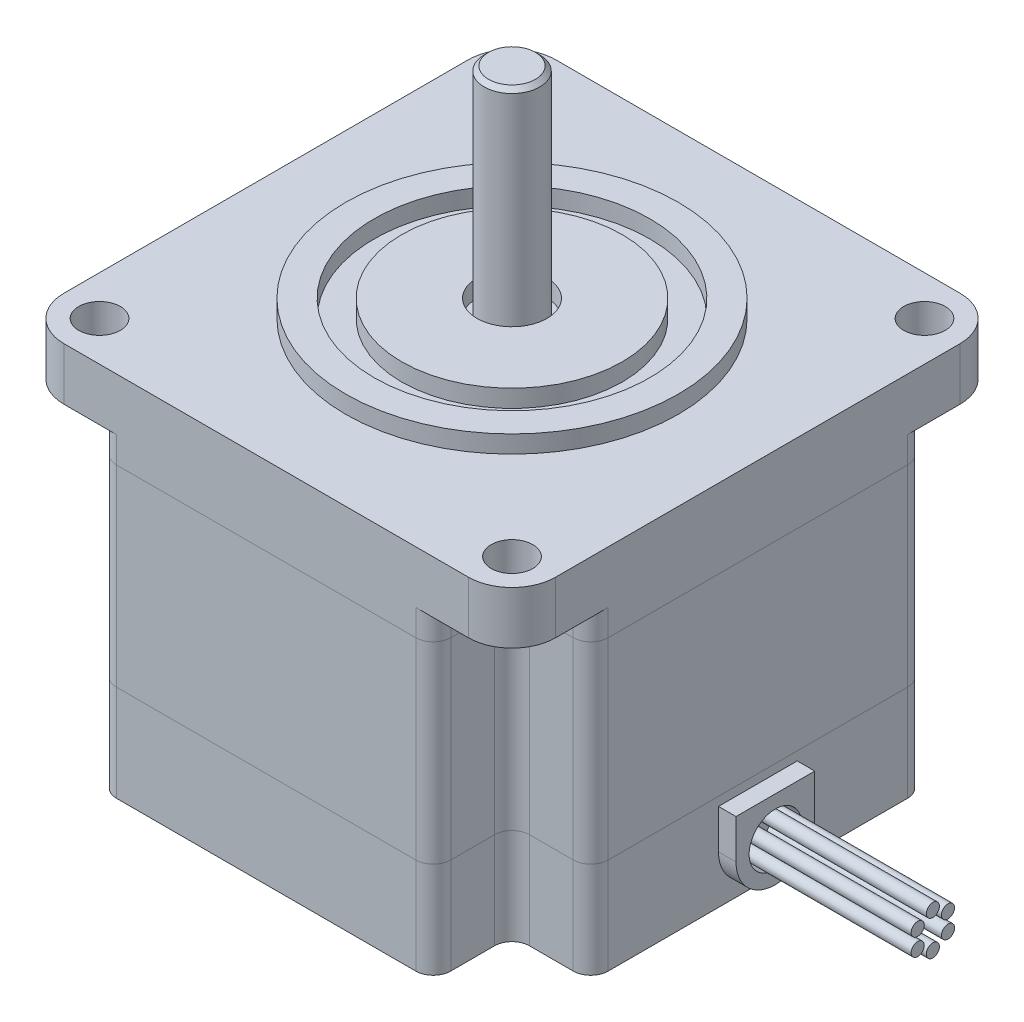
from build123d import *

# Parameters (mm, degrees)
SKETCH1_W             = 56.2
SKETCH1_H             = 56.2
SKETCH1_R             = 2.375
BOSS_EXTRUDE2_DEPTH   = 11
SKETCH2_W             = 56.2
SKETCH2_H             = 56.2
SKETCH2_R             = 2.375
BOSS_EXTRUDE3_DEPTH   = 22
SKETCH3_W             = 56.2
SKETCH3_H             = 56.2
SKETCH3_R             = 2.375
BOSS_EXTRUDE4_DEPTH   = 9
SKETCH4_R             = 3
BOSS_EXTRUDE5_DEPTH   = 2
SKETCH5_R             = 0.75
BOSS_EXTRUDE6_DEPTH   = 20
BOSS_EXTRUDE6_2_DEPTH = 20
BOSS_EXTRUDE6_3_DEPTH = 20
BOSS_EXTRUDE6_4_DEPTH = 20
BOSS_EXTRUDE6_5_DEPTH = 20
BOSS_EXTRUDE6_6_DEPTH = 20
SKETCH6_R             = 19
SKETCH6_R_2           = 15.75
SKETCH6_R_3           = 12.6
SKETCH6_R_4           = 4
BOSS_EXTRUDE7_DEPTH   = 2
SKETCH7_R             = 3.175
BOSS_EXTRUDE8_DEPTH   = 25
SKETCH11_W            = 9
SKETCH11_H            = 9
CUT_EXTRUDE1_DEPTH    = 36
FILLET1_R             = 5
FILLET2_R             = 2
FILLET3_R             = 2
CHAMFER1_SIZE         = 0.5
FILLET4_R             = 2


with BuildPart() as part:
    # Sketch1 → Boss-Extrude2 (new body)
    with BuildSketch(Plane(origin=(0, 0, 0), x_dir=(1, 0, 0), z_dir=(0, 1, 0))):
        Rectangle(SKETCH1_W, SKETCH1_H)
        with Locations(Location((23.57, 23.57, 0), (0, 0, 270))):
            Circle(SKETCH1_R, mode=Mode.SUBTRACT)
        with Locations(Location((23.57, -23.57, 0), (0, 0, 270))):
            Circle(SKETCH1_R, mode=Mode.SUBTRACT)
        with Locations(Location((-23.57, -23.57, 0), (0, 0, 270))):
            Circle(SKETCH1_R, mode=Mode.SUBTRACT)
        with Locations(Location((-23.57, 23.57, 0), (0, 0, 270))):
            Circle(SKETCH1_R, mode=Mode.SUBTRACT)
    extrude(amount=BOSS_EXTRUDE2_DEPTH)


with BuildPart() as body_2:
    # Sketch2 → Boss-Extrude3 (new body)
    with BuildSketch(Plane(origin=(0, 11, 0), x_dir=(1, 0, 0), z_dir=(0, 1, 0))):
        Rectangle(SKETCH2_W, SKETCH2_H)
        with Locations(Location((-23.57, -23.57, 0), (0, 0, 270))):
            Circle(SKETCH2_R, mode=Mode.SUBTRACT)
        with Locations(Location((23.57, -23.57, 0), (0, 0, 270))):
            Circle(SKETCH2_R, mode=Mode.SUBTRACT)
        with Locations(Location((23.57, 23.57, 0), (0, 0, 270))):
            Circle(SKETCH2_R, mode=Mode.SUBTRACT)
        with Locations(Location((-23.57, 23.57, 0), (0, 0, 270))):
            Circle(SKETCH2_R, mode=Mode.SUBTRACT)
    extrude(amount=BOSS_EXTRUDE3_DEPTH)


with BuildPart() as body_3:
    # Sketch3 → Boss-Extrude4 (new body)
    with BuildSketch(Plane(origin=(0, 33, 0), x_dir=(1, 0, 0), z_dir=(0, 1, 0))):
        Rectangle(SKETCH3_W, SKETCH3_H)
        with Locations(Location((23.57, 23.57, 0), (0, 0, 270))):
            Circle(SKETCH3_R, mode=Mode.SUBTRACT)
        with Locations(Location((23.57, -23.57, 0), (0, 0, 270))):
            Circle(SKETCH3_R, mode=Mode.SUBTRACT)
        with Locations(Location((-23.57, -23.57, 0), (0, 0, 270))):
            Circle(SKETCH3_R, mode=Mode.SUBTRACT)
        with Locations(Location((-23.57, 23.57, 0), (0, 0, 270))):
            Circle(SKETCH3_R, mode=Mode.SUBTRACT)
    extrude(amount=BOSS_EXTRUDE4_DEPTH)

    # Sketch6 → Boss-Extrude7 (add)
    # profile 1 of 2: a face of its own
    with BuildSketch(Plane(origin=(0, 42, 0), x_dir=(1, 0, 0), z_dir=(0, 1, 0))):
        with Locations(Location((0, 0, 0), (0, 0, 270))):
            Circle(SKETCH6_R)
        with Locations(Location((0, 0, 0), (0, 0, 270))):
            Circle(SKETCH6_R_2, mode=Mode.SUBTRACT)
    # profile 2 of 2: a face of its own
    with BuildSketch(Plane(origin=(0, 42, 0), x_dir=(1, 0, 0), z_dir=(0, 1, 0))):
        with Locations(Location((0, 0, 0), (0, 0, 270))):
            Circle(SKETCH6_R_3)
        with Locations(Location((0, 0, 0), (0, 0, 270))):
            Circle(SKETCH6_R_4, mode=Mode.SUBTRACT)
    extrude(amount=BOSS_EXTRUDE7_DEPTH)


with BuildPart() as body_4:
    # Sketch4 → Boss-Extrude5 (new body)
    with BuildSketch(Plane(origin=(28.1, 0, 0), x_dir=(0, 0, -1), z_dir=(1, 0, 0))):
        with BuildLine():
            Line((-4.5, 5.5), (-4.5, 10))
            Line((-4.5, 10), (4.5, 10))
            Line((4.5, 10), (4.5, 5.5))
            ThreePointArc((4.5, 5.5), (0, 1), (-4.5, 5.5))
        make_face()
        with Locations((0, 5.5)):
            Circle(SKETCH4_R, mode=Mode.SUBTRACT)
    extrude(amount=BOSS_EXTRUDE5_DEPTH)


with BuildPart() as body_5:
    # Sketch5 → Boss-Extrude6 (new body)
    with BuildSketch(Plane(origin=(28.1, 0, 0), x_dir=(0, 0, -1), z_dir=(1, 0, 0))):
        with Locations((-1.732050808, 4.5)):
            Circle(SKETCH5_R)
    extrude(amount=BOSS_EXTRUDE6_DEPTH)


with BuildPart() as body_6:
    # Sketch5 → Boss-Extrude6 2 (new body)
    with BuildSketch(Plane(origin=(28.1, 0, 0), x_dir=(0, 0, -1), z_dir=(1, 0, 0))):
        with Locations((0, 3.5)):
            Circle(SKETCH5_R)
    extrude(amount=BOSS_EXTRUDE6_2_DEPTH)


with BuildPart() as body_7:
    # Sketch5 → Boss-Extrude6 3 (new body)
    with BuildSketch(Plane(origin=(28.1, 0, 0), x_dir=(0, 0, -1), z_dir=(1, 0, 0))):
        with Locations((-1.732050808, 6.5)):
            Circle(SKETCH5_R)
    extrude(amount=BOSS_EXTRUDE6_3_DEPTH)


with BuildPart() as body_8:
    # Sketch5 → Boss-Extrude6 4 (new body)
    with BuildSketch(Plane(origin=(28.1, 0, 0), x_dir=(0, 0, -1), z_dir=(1, 0, 0))):
        with Locations((0, 7.5)):
            Circle(SKETCH5_R)
    extrude(amount=BOSS_EXTRUDE6_4_DEPTH)


with BuildPart() as body_9:
    # Sketch5 → Boss-Extrude6 5 (new body)
    with BuildSketch(Plane(origin=(28.1, 0, 0), x_dir=(0, 0, -1), z_dir=(1, 0, 0))):
        with Locations((1.732050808, 6.5)):
            Circle(SKETCH5_R)
    extrude(amount=BOSS_EXTRUDE6_5_DEPTH)


with BuildPart() as body_10:
    # Sketch5 → Boss-Extrude6 6 (new body)
    with BuildSketch(Plane(origin=(28.1, 0, 0), x_dir=(0, 0, -1), z_dir=(1, 0, 0))):
        with Locations((1.732050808, 4.5)):
            Circle(SKETCH5_R)
    extrude(amount=BOSS_EXTRUDE6_6_DEPTH)


with BuildPart() as body_11:
    # Sketch7 → Boss-Extrude8 (new body)
    with BuildSketch(Plane(origin=(0, 42, 0), x_dir=(1, 0, 0), z_dir=(0, 1, 0))):
        with Locations(Location((0, 0, 0), (0, 0, 270))):
            Circle(SKETCH7_R)
    extrude(amount=BOSS_EXTRUDE8_DEPTH)

    # Chamfer1
    chamfer1_edges = [body_11.edges().sort_by_distance(p)[0] for p in [
        (0, 67, -3.175),
    ]]
    chamfer(chamfer1_edges, length=CHAMFER1_SIZE)


with BuildPart() as cut_extrude1_tool:
    # Sketch11 → Cut-Extrude1 (new body)
    with BuildSketch(Plane.XZ):
        with Locations((-23.6, 23.6)):
            Rectangle(SKETCH11_W, SKETCH11_H)
        with Locations((23.6, 23.6)):
            Rectangle(SKETCH11_W, SKETCH11_H)
        with Locations((23.6, -23.6)):
            Rectangle(SKETCH11_W, SKETCH11_H)
        with Locations((-23.6, -23.6)):
            Rectangle(SKETCH11_W, SKETCH11_H)
    extrude(amount=-CUT_EXTRUDE1_DEPTH)


with BuildPart() as part_1:
    add(part.part)

    # Cut-Extrude1: cut by cut_extrude1_tool
    add(cut_extrude1_tool.part, mode=Mode.SUBTRACT)

    # Fillet2
    fillet2_edges = [part_1.edges().sort_by_distance(p)[0] for p in [
        (-19.1, 5.5, -28.1),
        (19.1, 5.5, -28.1),
        (28.1, 5.5, 19.1),
        (-19.1, 5.5, 28.1),
        (-19.1, 5.5, 19.1),
        (-28.1, 5.5, 19.1),
        (19.1, 5.5, 19.1),
        (19.1, 5.5, 28.1),
        (19.1, 5.5, -19.1),
        (28.1, 5.5, -19.1),
        (-19.1, 5.5, -19.1),
        (-28.1, 5.5, -19.1),
    ]]
    fillet(fillet2_edges, radius=FILLET2_R)


with BuildPart() as body_2_1:
    add(body_2.part)

    # Cut-Extrude1: cut by cut_extrude1_tool
    add(cut_extrude1_tool.part, mode=Mode.SUBTRACT)

    # Fillet3
    fillet3_edges = [body_2_1.edges().sort_by_distance(p)[0] for p in [
        (-19.1, 22, -28.1),
        (19.1, 22, -28.1),
        (28.1, 22, 19.1),
        (-19.1, 22, 28.1),
        (-19.1, 22, 19.1),
        (-28.1, 22, 19.1),
        (19.1, 22, 19.1),
        (19.1, 22, 28.1),
        (19.1, 22, -19.1),
        (28.1, 22, -19.1),
        (-28.1, 22, -19.1),
        (-19.1, 22, -19.1),
    ]]
    fillet(fillet3_edges, radius=FILLET3_R)


with BuildPart() as body_3_1:
    add(body_3.part)

    # Cut-Extrude1: cut by cut_extrude1_tool
    add(cut_extrude1_tool.part, mode=Mode.SUBTRACT)

    # Fillet1
    fillet1_edges = [body_3_1.edges().sort_by_distance(p)[0] for p in [
        (-28.1, 39, -28.1),
        (28.1, 39, -28.1),
        (28.1, 39, 28.1),
        (-28.1, 39, 28.1),
    ]]
    fillet(fillet1_edges, radius=FILLET1_R)

    # Fillet4
    fillet4_edges = [body_3_1.edges().sort_by_distance(p)[0] for p in [
        (-19.1, 34.5, 19.1),
        (-19.1, 34.5, 28.1),
        (-28.1, 34.5, 19.1),
        (19.1, 34.5, 19.1),
        (28.1, 34.5, 19.1),
        (19.1, 34.5, 28.1),
        (19.1, 34.5, -19.1),
        (19.1, 34.5, -28.1),
        (28.1, 34.5, -19.1),
        (-28.1, 34.5, -19.1),
        (-19.1, 34.5, -28.1),
        (-19.1, 34.5, -19.1),
    ]]
    fillet(fillet4_edges, radius=FILLET4_R)


solid = Compound([body_4.part, body_5.part, body_6.part, body_7.part, body_8.part, body_9.part, body_10.part, body_11.part, part_1.part, body_2_1.part, body_3_1.part])
